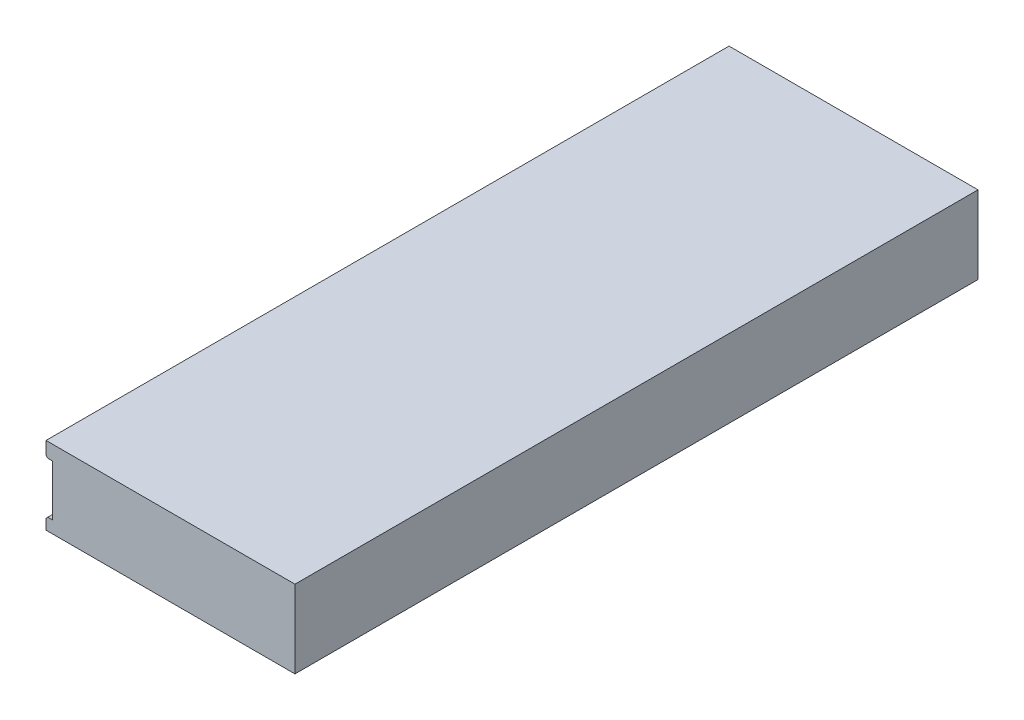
ISO-10303-21;
HEADER;
FILE_DESCRIPTION(('STEP AP214'),'2;1');
FILE_NAME('part.step','',(''),(''),'','','');
FILE_SCHEMA(('AUTOMOTIVE_DESIGN { 1 0 10303 214 1 1 1 1 }'));
ENDSEC;
DATA;
#1=APPLICATION_CONTEXT('core data for automotive mechanical design processes');
#2=APPLICATION_PROTOCOL_DEFINITION('international standard','automotive_design',2000,#1);
#3=PRODUCT_CONTEXT('',#1,'mechanical');
#4=PRODUCT('Part','Part','',(#3));
#5=PRODUCT_RELATED_PRODUCT_CATEGORY('part','',(#4));
#6=PRODUCT_DEFINITION_FORMATION('','',#4);
#7=PRODUCT_DEFINITION_CONTEXT('part definition',#1,'design');
#8=PRODUCT_DEFINITION('design','',#6,#7);
#9=PRODUCT_DEFINITION_SHAPE('','',#8);
#10=(LENGTH_UNIT() NAMED_UNIT(*) SI_UNIT(.MILLI.,.METRE.));
#11=(NAMED_UNIT(*) PLANE_ANGLE_UNIT() SI_UNIT($,.RADIAN.));
#12=(NAMED_UNIT(*) SI_UNIT($,.STERADIAN.) SOLID_ANGLE_UNIT());
#13=UNCERTAINTY_MEASURE_WITH_UNIT(LENGTH_MEASURE(1.E-05),#10,'distance_accuracy_value','');
#14=(GEOMETRIC_REPRESENTATION_CONTEXT(3) GLOBAL_UNCERTAINTY_ASSIGNED_CONTEXT((#13)) GLOBAL_UNIT_ASSIGNED_CONTEXT((#10,
#11,#12)) REPRESENTATION_CONTEXT('',''));
#15=CARTESIAN_POINT('',(0.,0.,0.));
#16=DIRECTION('',(0.,0.,1.));
#17=DIRECTION('',(1.,0.,0.));
#18=AXIS2_PLACEMENT_3D('',#15,#16,#17);
#19=CARTESIAN_POINT('',(-1.39699999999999,0.,71.4248));
#20=DIRECTION('',(0.,-1.,0.));
#21=DIRECTION('',(0.,0.,-1.));
#22=AXIS2_PLACEMENT_3D('',#19,#20,#21);
#23=PLANE('',#22);
#24=DIRECTION('',(-1.,0.,0.));
#25=VECTOR('',#24,1.);
#26=CARTESIAN_POINT('',(-1.39699999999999,0.,-71.4248));
#27=LINE('',#26,#25);
#28=CARTESIAN_POINT('',(50.673,0.,-71.4248));
#29=VERTEX_POINT('',#28);
#30=CARTESIAN_POINT('',(-1.39699999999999,0.,-71.4248));
#31=VERTEX_POINT('',#30);
#32=EDGE_CURVE('E180',#29,#31,#27,.T.);
#33=ORIENTED_EDGE('',*,*,#32,.T.);
#34=DIRECTION('',(0.,0.,-1.));
#35=VECTOR('',#34,1.);
#36=CARTESIAN_POINT('',(-1.39699999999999,0.,71.4248));
#37=LINE('',#36,#35);
#38=CARTESIAN_POINT('',(-1.39699999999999,0.,71.4248));
#39=VERTEX_POINT('',#38);
#40=EDGE_CURVE('E231',#39,#31,#37,.T.);
#41=ORIENTED_EDGE('',*,*,#40,.F.);
#42=DIRECTION('',(-1.,0.,0.));
#43=VECTOR('',#42,1.);
#44=CARTESIAN_POINT('',(-1.39699999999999,0.,71.4248));
#45=LINE('',#44,#43);
#46=CARTESIAN_POINT('',(50.673,0.,71.4248));
#47=VERTEX_POINT('',#46);
#48=EDGE_CURVE('E181',#47,#39,#45,.T.);
#49=ORIENTED_EDGE('',*,*,#48,.F.);
#50=DIRECTION('',(0.,0.,-1.));
#51=VECTOR('',#50,1.);
#52=CARTESIAN_POINT('',(50.673,0.,71.4248));
#53=LINE('',#52,#51);
#54=EDGE_CURVE('E200',#47,#29,#53,.T.);
#55=ORIENTED_EDGE('',*,*,#54,.T.);
#56=EDGE_LOOP('',(#33,#41,#49,#55));
#57=FACE_BOUND('',#56,.T.);
#58=ADVANCED_FACE('F37',(#57),#23,.F.);
#59=CARTESIAN_POINT('',(-1.39699999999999,-3.048,71.4248));
#60=DIRECTION('',(1.,0.,0.));
#61=DIRECTION('',(0.,0.,-1.));
#62=AXIS2_PLACEMENT_3D('',#59,#60,#61);
#63=PLANE('',#62);
#64=DIRECTION('',(0.,-1.,0.));
#65=VECTOR('',#64,1.);
#66=CARTESIAN_POINT('',(-1.39699999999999,-3.048,-71.4248));
#67=LINE('',#66,#65);
#68=CARTESIAN_POINT('',(-1.39699999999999,-2.66700000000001,-71.4248));
#69=VERTEX_POINT('',#68);
#70=EDGE_CURVE('E203',#31,#69,#67,.T.);
#71=ORIENTED_EDGE('',*,*,#70,.T.);
#72=DIRECTION('',(0.,0.,1.));
#73=VECTOR('',#72,1.);
#74=CARTESIAN_POINT('',(-1.39699999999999,-2.66700000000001,71.4248));
#75=LINE('',#74,#73);
#76=CARTESIAN_POINT('',(-1.39699999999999,-2.66700000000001,71.4248));
#77=VERTEX_POINT('',#76);
#78=EDGE_CURVE('E11',#69,#77,#75,.T.);
#79=ORIENTED_EDGE('',*,*,#78,.T.);
#80=DIRECTION('',(0.,-1.,0.));
#81=VECTOR('',#80,1.);
#82=CARTESIAN_POINT('',(-1.39699999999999,-3.048,71.4248));
#83=LINE('',#82,#81);
#84=EDGE_CURVE('E184',#39,#77,#83,.T.);
#85=ORIENTED_EDGE('',*,*,#84,.F.);
#86=ORIENTED_EDGE('',*,*,#40,.T.);
#87=EDGE_LOOP('',(#71,#79,#85,#86));
#88=FACE_BOUND('',#87,.T.);
#89=ADVANCED_FACE('F287',(#88),#63,.F.);
#90=CARTESIAN_POINT('',(0.,-3.048,71.4248));
#91=DIRECTION('',(0.,1.,0.));
#92=DIRECTION('',(0.,0.,1.));
#93=AXIS2_PLACEMENT_3D('',#90,#91,#92);
#94=PLANE('',#93);
#95=DIRECTION('',(1.,0.,0.));
#96=VECTOR('',#95,1.);
#97=CARTESIAN_POINT('',(0.,-3.048,71.4248));
#98=LINE('',#97,#96);
#99=CARTESIAN_POINT('',(-1.016,-3.048,71.4248));
#100=VERTEX_POINT('',#99);
#101=CARTESIAN_POINT('',(0.,-3.048,71.4248));
#102=VERTEX_POINT('',#101);
#103=EDGE_CURVE('E187',#100,#102,#98,.T.);
#104=ORIENTED_EDGE('',*,*,#103,.F.);
#105=DIRECTION('',(0.,0.,-1.));
#106=VECTOR('',#105,1.);
#107=CARTESIAN_POINT('',(-1.016,-3.048,71.4248));
#108=LINE('',#107,#106);
#109=CARTESIAN_POINT('',(-1.016,-3.048,-71.4248));
#110=VERTEX_POINT('',#109);
#111=EDGE_CURVE('E45',#100,#110,#108,.T.);
#112=ORIENTED_EDGE('',*,*,#111,.T.);
#113=DIRECTION('',(1.,0.,0.));
#114=VECTOR('',#113,1.);
#115=CARTESIAN_POINT('',(0.,-3.048,-71.4248));
#116=LINE('',#115,#114);
#117=CARTESIAN_POINT('',(0.,-3.048,-71.4248));
#118=VERTEX_POINT('',#117);
#119=EDGE_CURVE('E205',#110,#118,#116,.T.);
#120=ORIENTED_EDGE('',*,*,#119,.T.);
#121=DIRECTION('',(0.,0.,-1.));
#122=VECTOR('',#121,1.);
#123=CARTESIAN_POINT('',(0.,-3.048,71.4248));
#124=LINE('',#123,#122);
#125=EDGE_CURVE('E228',#102,#118,#124,.T.);
#126=ORIENTED_EDGE('',*,*,#125,.F.);
#127=EDGE_LOOP('',(#104,#112,#120,#126));
#128=FACE_BOUND('',#127,.T.);
#129=ADVANCED_FACE('F249',(#128),#94,.F.);
#130=CARTESIAN_POINT('',(0.,-13.716,71.4248));
#131=DIRECTION('',(1.,0.,0.));
#132=DIRECTION('',(0.,0.,-1.));
#133=AXIS2_PLACEMENT_3D('',#130,#131,#132);
#134=PLANE('',#133);
#135=CARTESIAN_POINT('',(0.,-8.128,-66.548));
#136=DIRECTION('',(-1.,0.,0.));
#137=DIRECTION('',(0.,0.,1.));
#138=AXIS2_PLACEMENT_3D('',#135,#136,#137);
#139=CIRCLE('',#138,2.413);
#140=CARTESIAN_POINT('',(0.,-8.128,-64.135));
#141=VERTEX_POINT('',#140);
#142=EDGE_CURVE('E141',#141,#141,#139,.T.);
#143=ORIENTED_EDGE('',*,*,#142,.F.);
#144=EDGE_LOOP('',(#143));
#145=FACE_BOUND('',#144,.T.);
#146=CARTESIAN_POINT('',(0.,-8.128,66.548));
#147=DIRECTION('',(-1.,0.,0.));
#148=DIRECTION('',(0.,0.,1.));
#149=AXIS2_PLACEMENT_3D('',#146,#147,#148);
#150=CIRCLE('',#149,2.413);
#151=CARTESIAN_POINT('',(0.,-8.128,68.961));
#152=VERTEX_POINT('',#151);
#153=EDGE_CURVE('E153',#152,#152,#150,.T.);
#154=ORIENTED_EDGE('',*,*,#153,.F.);
#155=EDGE_LOOP('',(#154));
#156=FACE_BOUND('',#155,.T.);
#157=CARTESIAN_POINT('',(0.,-8.128,4.8768));
#158=DIRECTION('',(-1.,0.,0.));
#159=DIRECTION('',(0.,0.,1.));
#160=AXIS2_PLACEMENT_3D('',#157,#158,#159);
#161=CIRCLE('',#160,2.413);
#162=CARTESIAN_POINT('',(0.,-8.128,7.2898));
#163=VERTEX_POINT('',#162);
#164=EDGE_CURVE('E165',#163,#163,#161,.T.);
#165=ORIENTED_EDGE('',*,*,#164,.F.);
#166=EDGE_LOOP('',(#165));
#167=FACE_BOUND('',#166,.T.);
#168=CARTESIAN_POINT('',(0.,-8.128,-4.8768));
#169=DIRECTION('',(-1.,0.,0.));
#170=DIRECTION('',(0.,0.,1.));
#171=AXIS2_PLACEMENT_3D('',#168,#169,#170);
#172=CIRCLE('',#171,2.413);
#173=CARTESIAN_POINT('',(0.,-8.128,-2.4638));
#174=VERTEX_POINT('',#173);
#175=EDGE_CURVE('E177',#174,#174,#172,.T.);
#176=ORIENTED_EDGE('',*,*,#175,.F.);
#177=EDGE_LOOP('',(#176));
#178=FACE_BOUND('',#177,.T.);
#179=DIRECTION('',(0.,-1.,0.));
#180=VECTOR('',#179,1.);
#181=CARTESIAN_POINT('',(0.,-13.716,-71.4248));
#182=LINE('',#181,#180);
#183=CARTESIAN_POINT('',(0.,-13.716,-71.4248));
#184=VERTEX_POINT('',#183);
#185=EDGE_CURVE('E207',#118,#184,#182,.T.);
#186=ORIENTED_EDGE('',*,*,#185,.T.);
#187=DIRECTION('',(0.,0.,-1.));
#188=VECTOR('',#187,1.);
#189=CARTESIAN_POINT('',(0.,-13.716,71.4248));
#190=LINE('',#189,#188);
#191=CARTESIAN_POINT('',(0.,-13.716,71.4248));
#192=VERTEX_POINT('',#191);
#193=EDGE_CURVE('E225',#192,#184,#190,.T.);
#194=ORIENTED_EDGE('',*,*,#193,.F.);
#195=DIRECTION('',(0.,-1.,0.));
#196=VECTOR('',#195,1.);
#197=CARTESIAN_POINT('',(0.,-13.716,71.4248));
#198=LINE('',#197,#196);
#199=EDGE_CURVE('E189',#102,#192,#198,.T.);
#200=ORIENTED_EDGE('',*,*,#199,.F.);
#201=ORIENTED_EDGE('',*,*,#125,.T.);
#202=EDGE_LOOP('',(#186,#194,#200,#201));
#203=FACE_BOUND('',#202,.T.);
#204=ADVANCED_FACE('F259',(#145,#156,#167,#178,#203),#134,.F.);
#205=CARTESIAN_POINT('',(-1.39699999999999,-13.716,71.4248));
#206=DIRECTION('',(0.,-1.,0.));
#207=DIRECTION('',(0.,0.,-1.));
#208=AXIS2_PLACEMENT_3D('',#205,#206,#207);
#209=PLANE('',#208);
#210=DIRECTION('',(-1.,0.,0.));
#211=VECTOR('',#210,1.);
#212=CARTESIAN_POINT('',(-1.39699999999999,-13.716,-71.4248));
#213=LINE('',#212,#211);
#214=CARTESIAN_POINT('',(-1.016,-13.716,-71.4248));
#215=VERTEX_POINT('',#214);
#216=EDGE_CURVE('E209',#184,#215,#213,.T.);
#217=ORIENTED_EDGE('',*,*,#216,.T.);
#218=DIRECTION('',(0.,0.,1.));
#219=VECTOR('',#218,1.);
#220=CARTESIAN_POINT('',(-1.016,-13.716,71.4248));
#221=LINE('',#220,#219);
#222=CARTESIAN_POINT('',(-1.016,-13.716,71.4248));
#223=VERTEX_POINT('',#222);
#224=EDGE_CURVE('E241',#215,#223,#221,.T.);
#225=ORIENTED_EDGE('',*,*,#224,.T.);
#226=DIRECTION('',(-1.,0.,0.));
#227=VECTOR('',#226,1.);
#228=CARTESIAN_POINT('',(-1.39699999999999,-13.716,71.4248));
#229=LINE('',#228,#227);
#230=EDGE_CURVE('E191',#192,#223,#229,.T.);
#231=ORIENTED_EDGE('',*,*,#230,.F.);
#232=ORIENTED_EDGE('',*,*,#193,.T.);
#233=EDGE_LOOP('',(#217,#225,#231,#232));
#234=FACE_BOUND('',#233,.T.);
#235=ADVANCED_FACE('F263',(#234),#209,.F.);
#236=CARTESIAN_POINT('',(-1.39699999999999,-16.256,71.4248));
#237=DIRECTION('',(1.,0.,0.));
#238=DIRECTION('',(0.,0.,-1.));
#239=AXIS2_PLACEMENT_3D('',#236,#237,#238);
#240=PLANE('',#239);
#241=DIRECTION('',(0.,-1.,0.));
#242=VECTOR('',#241,1.);
#243=CARTESIAN_POINT('',(-1.39699999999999,-16.256,71.4248));
#244=LINE('',#243,#242);
#245=CARTESIAN_POINT('',(-1.39699999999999,-14.097,71.4248));
#246=VERTEX_POINT('',#245);
#247=CARTESIAN_POINT('',(-1.39699999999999,-16.256,71.4248));
#248=VERTEX_POINT('',#247);
#249=EDGE_CURVE('E194',#246,#248,#244,.T.);
#250=ORIENTED_EDGE('',*,*,#249,.F.);
#251=DIRECTION('',(0.,0.,-1.));
#252=VECTOR('',#251,1.);
#253=CARTESIAN_POINT('',(-1.39699999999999,-14.097,71.4248));
#254=LINE('',#253,#252);
#255=CARTESIAN_POINT('',(-1.39699999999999,-14.097,-71.4248));
#256=VERTEX_POINT('',#255);
#257=EDGE_CURVE('E234',#246,#256,#254,.T.);
#258=ORIENTED_EDGE('',*,*,#257,.T.);
#259=DIRECTION('',(0.,-1.,0.));
#260=VECTOR('',#259,1.);
#261=CARTESIAN_POINT('',(-1.39699999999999,-16.256,-71.4248));
#262=LINE('',#261,#260);
#263=CARTESIAN_POINT('',(-1.39699999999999,-16.256,-71.4248));
#264=VERTEX_POINT('',#263);
#265=EDGE_CURVE('E212',#256,#264,#262,.T.);
#266=ORIENTED_EDGE('',*,*,#265,.T.);
#267=DIRECTION('',(0.,0.,-1.));
#268=VECTOR('',#267,1.);
#269=CARTESIAN_POINT('',(-1.39699999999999,-16.256,71.4248));
#270=LINE('',#269,#268);
#271=EDGE_CURVE('E222',#248,#264,#270,.T.);
#272=ORIENTED_EDGE('',*,*,#271,.F.);
#273=EDGE_LOOP('',(#250,#258,#266,#272));
#274=FACE_BOUND('',#273,.T.);
#275=ADVANCED_FACE('F271',(#274),#240,.F.);
#276=CARTESIAN_POINT('',(50.673,-16.256,71.4248));
#277=DIRECTION('',(0.,1.,0.));
#278=DIRECTION('',(-1.,0.,0.));
#279=AXIS2_PLACEMENT_3D('',#276,#277,#278);
#280=PLANE('',#279);
#281=DIRECTION('',(1.,0.,0.));
#282=VECTOR('',#281,1.);
#283=CARTESIAN_POINT('',(50.673,-16.256,-71.4248));
#284=LINE('',#283,#282);
#285=CARTESIAN_POINT('',(50.673,-16.256,-71.4248));
#286=VERTEX_POINT('',#285);
#287=EDGE_CURVE('E214',#264,#286,#284,.T.);
#288=ORIENTED_EDGE('',*,*,#287,.T.);
#289=DIRECTION('',(0.,0.,-1.));
#290=VECTOR('',#289,1.);
#291=CARTESIAN_POINT('',(50.673,-16.256,71.4248));
#292=LINE('',#291,#290);
#293=CARTESIAN_POINT('',(50.673,-16.256,71.4248));
#294=VERTEX_POINT('',#293);
#295=EDGE_CURVE('E219',#294,#286,#292,.T.);
#296=ORIENTED_EDGE('',*,*,#295,.F.);
#297=DIRECTION('',(1.,0.,0.));
#298=VECTOR('',#297,1.);
#299=CARTESIAN_POINT('',(50.673,-16.256,71.4248));
#300=LINE('',#299,#298);
#301=EDGE_CURVE('E196',#248,#294,#300,.T.);
#302=ORIENTED_EDGE('',*,*,#301,.F.);
#303=ORIENTED_EDGE('',*,*,#271,.T.);
#304=EDGE_LOOP('',(#288,#296,#302,#303));
#305=FACE_BOUND('',#304,.T.);
#306=ADVANCED_FACE('F278',(#305),#280,.F.);
#307=CARTESIAN_POINT('',(50.673,0.,71.4248));
#308=DIRECTION('',(-1.,0.,0.));
#309=DIRECTION('',(0.,0.,1.));
#310=AXIS2_PLACEMENT_3D('',#307,#308,#309);
#311=PLANE('',#310);
#312=DIRECTION('',(0.,1.,0.));
#313=VECTOR('',#312,1.);
#314=CARTESIAN_POINT('',(50.673,0.,-71.4248));
#315=LINE('',#314,#313);
#316=EDGE_CURVE('E185',#286,#29,#315,.T.);
#317=ORIENTED_EDGE('',*,*,#316,.T.);
#318=ORIENTED_EDGE('',*,*,#54,.F.);
#319=DIRECTION('',(0.,1.,0.));
#320=VECTOR('',#319,1.);
#321=CARTESIAN_POINT('',(50.673,0.,71.4248));
#322=LINE('',#321,#320);
#323=EDGE_CURVE('E198',#294,#47,#322,.T.);
#324=ORIENTED_EDGE('',*,*,#323,.F.);
#325=ORIENTED_EDGE('',*,*,#295,.T.);
#326=EDGE_LOOP('',(#317,#318,#324,#325));
#327=FACE_BOUND('',#326,.T.);
#328=ADVANCED_FACE('F282',(#327),#311,.F.);
#329=CARTESIAN_POINT('',(50.673,0.,71.4248));
#330=DIRECTION('',(0.,0.,-1.));
#331=DIRECTION('',(-1.,0.,0.));
#332=AXIS2_PLACEMENT_3D('',#329,#330,#331);
#333=PLANE('',#332);
#334=ORIENTED_EDGE('',*,*,#230,.T.);
#335=DIRECTION('',(0.70710678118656,0.707106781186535,0.));
#336=VECTOR('',#335,1.);
#337=CARTESIAN_POINT('',(-1.39699999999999,-14.097,71.4248));
#338=LINE('',#337,#336);
#339=EDGE_CURVE('E244',#223,#246,#338,.F.);
#340=ORIENTED_EDGE('',*,*,#339,.T.);
#341=ORIENTED_EDGE('',*,*,#249,.T.);
#342=ORIENTED_EDGE('',*,*,#301,.T.);
#343=ORIENTED_EDGE('',*,*,#323,.T.);
#344=ORIENTED_EDGE('',*,*,#48,.T.);
#345=ORIENTED_EDGE('',*,*,#84,.T.);
#346=DIRECTION('',(-0.707106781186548,0.707106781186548,0.));
#347=VECTOR('',#346,1.);
#348=CARTESIAN_POINT('',(-1.016,-3.048,71.4248));
#349=LINE('',#348,#347);
#350=EDGE_CURVE('E52',#77,#100,#349,.F.);
#351=ORIENTED_EDGE('',*,*,#350,.T.);
#352=ORIENTED_EDGE('',*,*,#103,.T.);
#353=ORIENTED_EDGE('',*,*,#199,.T.);
#354=EDGE_LOOP('',(#334,#340,#341,#342,#343,#344,#345,#351,#352,#353));
#355=FACE_BOUND('',#354,.T.);
#356=ADVANCED_FACE('F266',(#355),#333,.F.);
#357=CARTESIAN_POINT('',(50.673,0.,-71.4248));
#358=DIRECTION('',(0.,0.,-1.));
#359=DIRECTION('',(-1.,0.,0.));
#360=AXIS2_PLACEMENT_3D('',#357,#358,#359);
#361=PLANE('',#360);
#362=ORIENTED_EDGE('',*,*,#265,.F.);
#363=DIRECTION('',(-0.70710678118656,-0.707106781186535,0.));
#364=VECTOR('',#363,1.);
#365=CARTESIAN_POINT('',(31.686500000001,18.9864999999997,-71.4248));
#366=LINE('',#365,#364);
#367=EDGE_CURVE('E239',#256,#215,#366,.F.);
#368=ORIENTED_EDGE('',*,*,#367,.T.);
#369=ORIENTED_EDGE('',*,*,#216,.F.);
#370=ORIENTED_EDGE('',*,*,#185,.F.);
#371=ORIENTED_EDGE('',*,*,#119,.F.);
#372=DIRECTION('',(0.707106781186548,-0.707106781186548,0.));
#373=VECTOR('',#372,1.);
#374=CARTESIAN_POINT('',(23.3045,-27.3685,-71.4248));
#375=LINE('',#374,#373);
#376=EDGE_CURVE('E237',#110,#69,#375,.F.);
#377=ORIENTED_EDGE('',*,*,#376,.T.);
#378=ORIENTED_EDGE('',*,*,#70,.F.);
#379=ORIENTED_EDGE('',*,*,#32,.F.);
#380=ORIENTED_EDGE('',*,*,#316,.F.);
#381=ORIENTED_EDGE('',*,*,#287,.F.);
#382=EDGE_LOOP('',(#362,#368,#369,#370,#371,#377,#378,#379,#380,#381));
#383=FACE_BOUND('',#382,.T.);
#384=ADVANCED_FACE('F255',(#383),#361,.T.);
#385=CARTESIAN_POINT('',(0.,-8.128,-4.8768));
#386=DIRECTION('',(-1.,0.,0.));
#387=DIRECTION('',(0.,0.,1.));
#388=AXIS2_PLACEMENT_3D('',#385,#386,#387);
#389=CYLINDRICAL_SURFACE('',#388,2.413);
#390=CARTESIAN_POINT('',(7.62,-8.128,-4.8768));
#391=DIRECTION('',(-1.,0.,0.));
#392=DIRECTION('',(0.,0.,1.));
#393=AXIS2_PLACEMENT_3D('',#390,#391,#392);
#394=CIRCLE('',#393,2.413);
#395=CARTESIAN_POINT('',(7.62,-8.128,-2.4638));
#396=VERTEX_POINT('',#395);
#397=EDGE_CURVE('E174',#396,#396,#394,.T.);
#398=ORIENTED_EDGE('',*,*,#397,.F.);
#399=EDGE_LOOP('',(#398));
#400=FACE_BOUND('',#399,.T.);
#401=ORIENTED_EDGE('',*,*,#175,.T.);
#402=EDGE_LOOP('',(#401));
#403=FACE_BOUND('',#402,.T.);
#404=ADVANCED_FACE('F314',(#400,#403),#389,.F.);
#405=CARTESIAN_POINT('',(7.62,-6.10870000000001,-4.8768));
#406=DIRECTION('',(1.,0.,0.));
#407=DIRECTION('',(0.,0.,-1.));
#408=AXIS2_PLACEMENT_3D('',#405,#406,#407);
#409=PLANE('',#408);
#410=CARTESIAN_POINT('',(7.62,-8.128,-4.8768));
#411=DIRECTION('',(-1.,0.,0.));
#412=DIRECTION('',(0.,0.,1.));
#413=AXIS2_PLACEMENT_3D('',#410,#411,#412);
#414=CIRCLE('',#413,2.0193);
#415=CARTESIAN_POINT('',(7.62,-8.128,-2.8575));
#416=VERTEX_POINT('',#415);
#417=EDGE_CURVE('E171',#416,#416,#414,.T.);
#418=ORIENTED_EDGE('',*,*,#417,.F.);
#419=EDGE_LOOP('',(#418));
#420=FACE_BOUND('',#419,.T.);
#421=ORIENTED_EDGE('',*,*,#397,.T.);
#422=EDGE_LOOP('',(#421));
#423=FACE_BOUND('',#422,.T.);
#424=ADVANCED_FACE('F319',(#420,#423),#409,.F.);
#425=CARTESIAN_POINT('',(0.,-8.128,-4.8768));
#426=DIRECTION('',(-1.,0.,0.));
#427=DIRECTION('',(0.,0.,1.));
#428=AXIS2_PLACEMENT_3D('',#425,#426,#427);
#429=CYLINDRICAL_SURFACE('',#428,2.0193);
#430=CARTESIAN_POINT('',(9.99744,-8.128,-4.8768));
#431=DIRECTION('',(-1.,0.,0.));
#432=DIRECTION('',(0.,0.,1.));
#433=AXIS2_PLACEMENT_3D('',#430,#431,#432);
#434=CIRCLE('',#433,2.0193);
#435=CARTESIAN_POINT('',(9.99744,-8.128,-2.8575));
#436=VERTEX_POINT('',#435);
#437=EDGE_CURVE('E168',#436,#436,#434,.T.);
#438=ORIENTED_EDGE('',*,*,#437,.F.);
#439=EDGE_LOOP('',(#438));
#440=FACE_BOUND('',#439,.T.);
#441=ORIENTED_EDGE('',*,*,#417,.T.);
#442=EDGE_LOOP('',(#441));
#443=FACE_BOUND('',#442,.T.);
#444=ADVANCED_FACE('F323',(#440,#443),#429,.F.);
#445=CARTESIAN_POINT('',(9.99744,-8.128,-4.8768));
#446=DIRECTION('',(-1.,0.,0.));
#447=DIRECTION('',(0.,0.,1.));
#448=AXIS2_PLACEMENT_3D('',#445,#446,#447);
#449=CONICAL_SURFACE('',#448,2.0193,1.02974425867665);
#450=CARTESIAN_POINT('',(11.2107578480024,-8.12800000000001,-4.8768));
#451=VERTEX_POINT('',#450);
#452=VERTEX_LOOP('',#451);
#453=FACE_BOUND('',#452,.T.);
#454=ORIENTED_EDGE('',*,*,#437,.T.);
#455=EDGE_LOOP('',(#454));
#456=FACE_BOUND('',#455,.T.);
#457=ADVANCED_FACE('F327',(#453,#456),#449,.F.);
#458=CARTESIAN_POINT('',(0.,-8.128,4.8768));
#459=DIRECTION('',(-1.,0.,0.));
#460=DIRECTION('',(0.,0.,1.));
#461=AXIS2_PLACEMENT_3D('',#458,#459,#460);
#462=CYLINDRICAL_SURFACE('',#461,2.413);
#463=CARTESIAN_POINT('',(7.62,-8.128,4.8768));
#464=DIRECTION('',(-1.,0.,0.));
#465=DIRECTION('',(0.,0.,1.));
#466=AXIS2_PLACEMENT_3D('',#463,#464,#465);
#467=CIRCLE('',#466,2.413);
#468=CARTESIAN_POINT('',(7.62,-8.128,7.2898));
#469=VERTEX_POINT('',#468);
#470=EDGE_CURVE('E162',#469,#469,#467,.T.);
#471=ORIENTED_EDGE('',*,*,#470,.F.);
#472=EDGE_LOOP('',(#471));
#473=FACE_BOUND('',#472,.T.);
#474=ORIENTED_EDGE('',*,*,#164,.T.);
#475=EDGE_LOOP('',(#474));
#476=FACE_BOUND('',#475,.T.);
#477=ADVANCED_FACE('F331',(#473,#476),#462,.F.);
#478=CARTESIAN_POINT('',(7.62,-6.10870000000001,4.8768));
#479=DIRECTION('',(1.,0.,0.));
#480=DIRECTION('',(0.,0.,-1.));
#481=AXIS2_PLACEMENT_3D('',#478,#479,#480);
#482=PLANE('',#481);
#483=CARTESIAN_POINT('',(7.62,-8.128,4.8768));
#484=DIRECTION('',(-1.,0.,0.));
#485=DIRECTION('',(0.,0.,1.));
#486=AXIS2_PLACEMENT_3D('',#483,#484,#485);
#487=CIRCLE('',#486,2.0193);
#488=CARTESIAN_POINT('',(7.62,-8.128,6.8961));
#489=VERTEX_POINT('',#488);
#490=EDGE_CURVE('E159',#489,#489,#487,.T.);
#491=ORIENTED_EDGE('',*,*,#490,.F.);
#492=EDGE_LOOP('',(#491));
#493=FACE_BOUND('',#492,.T.);
#494=ORIENTED_EDGE('',*,*,#470,.T.);
#495=EDGE_LOOP('',(#494));
#496=FACE_BOUND('',#495,.T.);
#497=ADVANCED_FACE('F335',(#493,#496),#482,.F.);
#498=CARTESIAN_POINT('',(0.,-8.128,4.8768));
#499=DIRECTION('',(-1.,0.,0.));
#500=DIRECTION('',(0.,0.,1.));
#501=AXIS2_PLACEMENT_3D('',#498,#499,#500);
#502=CYLINDRICAL_SURFACE('',#501,2.0193);
#503=CARTESIAN_POINT('',(9.99744,-8.128,4.8768));
#504=DIRECTION('',(-1.,0.,0.));
#505=DIRECTION('',(0.,0.,1.));
#506=AXIS2_PLACEMENT_3D('',#503,#504,#505);
#507=CIRCLE('',#506,2.0193);
#508=CARTESIAN_POINT('',(9.99744,-8.128,6.8961));
#509=VERTEX_POINT('',#508);
#510=EDGE_CURVE('E156',#509,#509,#507,.T.);
#511=ORIENTED_EDGE('',*,*,#510,.F.);
#512=EDGE_LOOP('',(#511));
#513=FACE_BOUND('',#512,.T.);
#514=ORIENTED_EDGE('',*,*,#490,.T.);
#515=EDGE_LOOP('',(#514));
#516=FACE_BOUND('',#515,.T.);
#517=ADVANCED_FACE('F339',(#513,#516),#502,.F.);
#518=CARTESIAN_POINT('',(9.99744,-8.128,4.8768));
#519=DIRECTION('',(-1.,0.,0.));
#520=DIRECTION('',(0.,0.,1.));
#521=AXIS2_PLACEMENT_3D('',#518,#519,#520);
#522=CONICAL_SURFACE('',#521,2.0193,1.02974425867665);
#523=CARTESIAN_POINT('',(11.2107578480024,-8.12800000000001,4.8768));
#524=VERTEX_POINT('',#523);
#525=VERTEX_LOOP('',#524);
#526=FACE_BOUND('',#525,.T.);
#527=ORIENTED_EDGE('',*,*,#510,.T.);
#528=EDGE_LOOP('',(#527));
#529=FACE_BOUND('',#528,.T.);
#530=ADVANCED_FACE('F343',(#526,#529),#522,.F.);
#531=CARTESIAN_POINT('',(0.,-8.128,66.548));
#532=DIRECTION('',(-1.,0.,0.));
#533=DIRECTION('',(0.,0.,1.));
#534=AXIS2_PLACEMENT_3D('',#531,#532,#533);
#535=CYLINDRICAL_SURFACE('',#534,2.413);
#536=CARTESIAN_POINT('',(7.62,-8.128,66.548));
#537=DIRECTION('',(-1.,0.,0.));
#538=DIRECTION('',(0.,0.,1.));
#539=AXIS2_PLACEMENT_3D('',#536,#537,#538);
#540=CIRCLE('',#539,2.413);
#541=CARTESIAN_POINT('',(7.62,-8.128,68.961));
#542=VERTEX_POINT('',#541);
#543=EDGE_CURVE('E150',#542,#542,#540,.T.);
#544=ORIENTED_EDGE('',*,*,#543,.F.);
#545=EDGE_LOOP('',(#544));
#546=FACE_BOUND('',#545,.T.);
#547=ORIENTED_EDGE('',*,*,#153,.T.);
#548=EDGE_LOOP('',(#547));
#549=FACE_BOUND('',#548,.T.);
#550=ADVANCED_FACE('F347',(#546,#549),#535,.F.);
#551=CARTESIAN_POINT('',(7.62,-6.10870000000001,66.548));
#552=DIRECTION('',(1.,0.,0.));
#553=DIRECTION('',(0.,0.,-1.));
#554=AXIS2_PLACEMENT_3D('',#551,#552,#553);
#555=PLANE('',#554);
#556=CARTESIAN_POINT('',(7.62,-8.128,66.548));
#557=DIRECTION('',(-1.,0.,0.));
#558=DIRECTION('',(0.,0.,1.));
#559=AXIS2_PLACEMENT_3D('',#556,#557,#558);
#560=CIRCLE('',#559,2.0193);
#561=CARTESIAN_POINT('',(7.62,-8.128,68.5673));
#562=VERTEX_POINT('',#561);
#563=EDGE_CURVE('E147',#562,#562,#560,.T.);
#564=ORIENTED_EDGE('',*,*,#563,.F.);
#565=EDGE_LOOP('',(#564));
#566=FACE_BOUND('',#565,.T.);
#567=ORIENTED_EDGE('',*,*,#543,.T.);
#568=EDGE_LOOP('',(#567));
#569=FACE_BOUND('',#568,.T.);
#570=ADVANCED_FACE('F351',(#566,#569),#555,.F.);
#571=CARTESIAN_POINT('',(0.,-8.128,66.548));
#572=DIRECTION('',(-1.,0.,0.));
#573=DIRECTION('',(0.,0.,1.));
#574=AXIS2_PLACEMENT_3D('',#571,#572,#573);
#575=CYLINDRICAL_SURFACE('',#574,2.0193);
#576=CARTESIAN_POINT('',(9.99744,-8.128,66.548));
#577=DIRECTION('',(-1.,0.,0.));
#578=DIRECTION('',(0.,0.,1.));
#579=AXIS2_PLACEMENT_3D('',#576,#577,#578);
#580=CIRCLE('',#579,2.0193);
#581=CARTESIAN_POINT('',(9.99744,-8.128,68.5673));
#582=VERTEX_POINT('',#581);
#583=EDGE_CURVE('E144',#582,#582,#580,.T.);
#584=ORIENTED_EDGE('',*,*,#583,.F.);
#585=EDGE_LOOP('',(#584));
#586=FACE_BOUND('',#585,.T.);
#587=ORIENTED_EDGE('',*,*,#563,.T.);
#588=EDGE_LOOP('',(#587));
#589=FACE_BOUND('',#588,.T.);
#590=ADVANCED_FACE('F355',(#586,#589),#575,.F.);
#591=CARTESIAN_POINT('',(9.99744,-8.128,66.548));
#592=DIRECTION('',(-1.,0.,0.));
#593=DIRECTION('',(0.,0.,1.));
#594=AXIS2_PLACEMENT_3D('',#591,#592,#593);
#595=CONICAL_SURFACE('',#594,2.0193,1.02974425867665);
#596=CARTESIAN_POINT('',(11.2107578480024,-8.12800000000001,66.548));
#597=VERTEX_POINT('',#596);
#598=VERTEX_LOOP('',#597);
#599=FACE_BOUND('',#598,.T.);
#600=ORIENTED_EDGE('',*,*,#583,.T.);
#601=EDGE_LOOP('',(#600));
#602=FACE_BOUND('',#601,.T.);
#603=ADVANCED_FACE('F359',(#599,#602),#595,.F.);
#604=CARTESIAN_POINT('',(0.,-8.128,-66.548));
#605=DIRECTION('',(-1.,0.,0.));
#606=DIRECTION('',(0.,0.,1.));
#607=AXIS2_PLACEMENT_3D('',#604,#605,#606);
#608=CYLINDRICAL_SURFACE('',#607,2.413);
#609=CARTESIAN_POINT('',(7.61999999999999,-8.128,-66.548));
#610=DIRECTION('',(-1.,0.,0.));
#611=DIRECTION('',(0.,0.,1.));
#612=AXIS2_PLACEMENT_3D('',#609,#610,#611);
#613=CIRCLE('',#612,2.413);
#614=CARTESIAN_POINT('',(7.61999999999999,-8.128,-64.135));
#615=VERTEX_POINT('',#614);
#616=EDGE_CURVE('E136',#615,#615,#613,.T.);
#617=ORIENTED_EDGE('',*,*,#616,.F.);
#618=EDGE_LOOP('',(#617));
#619=FACE_BOUND('',#618,.T.);
#620=ORIENTED_EDGE('',*,*,#142,.T.);
#621=EDGE_LOOP('',(#620));
#622=FACE_BOUND('',#621,.T.);
#623=ADVANCED_FACE('F363',(#619,#622),#608,.F.);
#624=CARTESIAN_POINT('',(7.61999999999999,-6.10870000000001,-66.548));
#625=DIRECTION('',(1.,0.,0.));
#626=DIRECTION('',(0.,0.,-1.));
#627=AXIS2_PLACEMENT_3D('',#624,#625,#626);
#628=PLANE('',#627);
#629=CARTESIAN_POINT('',(7.61999999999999,-8.128,-66.548));
#630=DIRECTION('',(-1.,0.,0.));
#631=DIRECTION('',(0.,0.,1.));
#632=AXIS2_PLACEMENT_3D('',#629,#630,#631);
#633=CIRCLE('',#632,2.0193);
#634=CARTESIAN_POINT('',(7.61999999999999,-8.128,-64.5287));
#635=VERTEX_POINT('',#634);
#636=EDGE_CURVE('E133',#635,#635,#633,.T.);
#637=ORIENTED_EDGE('',*,*,#636,.F.);
#638=EDGE_LOOP('',(#637));
#639=FACE_BOUND('',#638,.T.);
#640=ORIENTED_EDGE('',*,*,#616,.T.);
#641=EDGE_LOOP('',(#640));
#642=FACE_BOUND('',#641,.T.);
#643=ADVANCED_FACE('F367',(#639,#642),#628,.F.);
#644=CARTESIAN_POINT('',(0.,-8.128,-66.548));
#645=DIRECTION('',(-1.,0.,0.));
#646=DIRECTION('',(0.,0.,1.));
#647=AXIS2_PLACEMENT_3D('',#644,#645,#646);
#648=CYLINDRICAL_SURFACE('',#647,2.0193);
#649=CARTESIAN_POINT('',(9.99744,-8.128,-66.548));
#650=DIRECTION('',(-1.,0.,0.));
#651=DIRECTION('',(0.,0.,1.));
#652=AXIS2_PLACEMENT_3D('',#649,#650,#651);
#653=CIRCLE('',#652,2.0193);
#654=CARTESIAN_POINT('',(9.99744,-8.128,-64.5287));
#655=VERTEX_POINT('',#654);
#656=EDGE_CURVE('E131',#655,#655,#653,.T.);
#657=ORIENTED_EDGE('',*,*,#656,.F.);
#658=EDGE_LOOP('',(#657));
#659=FACE_BOUND('',#658,.T.);
#660=ORIENTED_EDGE('',*,*,#636,.T.);
#661=EDGE_LOOP('',(#660));
#662=FACE_BOUND('',#661,.T.);
#663=ADVANCED_FACE('F127',(#659,#662),#648,.F.);
#664=CARTESIAN_POINT('',(9.99744,-8.128,-66.548));
#665=DIRECTION('',(-1.,0.,0.));
#666=DIRECTION('',(0.,0.,1.));
#667=AXIS2_PLACEMENT_3D('',#664,#665,#666);
#668=CONICAL_SURFACE('',#667,2.0193,1.02974425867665);
#669=CARTESIAN_POINT('',(11.2107578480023,-8.12800000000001,-66.548));
#670=VERTEX_POINT('',#669);
#671=VERTEX_LOOP('',#670);
#672=FACE_BOUND('',#671,.T.);
#673=ORIENTED_EDGE('',*,*,#656,.T.);
#674=EDGE_LOOP('',(#673));
#675=FACE_BOUND('',#674,.T.);
#676=ADVANCED_FACE('F123',(#672,#675),#668,.F.);
#677=CARTESIAN_POINT('',(-1.39699999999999,-14.097,71.4248));
#678=DIRECTION('',(0.707106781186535,-0.70710678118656,0.));
#679=DIRECTION('',(0.70710678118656,0.707106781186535,0.));
#680=AXIS2_PLACEMENT_3D('',#677,#678,#679);
#681=PLANE('',#680);
#682=ORIENTED_EDGE('',*,*,#339,.F.);
#683=ORIENTED_EDGE('',*,*,#224,.F.);
#684=ORIENTED_EDGE('',*,*,#367,.F.);
#685=ORIENTED_EDGE('',*,*,#257,.F.);
#686=EDGE_LOOP('',(#682,#683,#684,#685));
#687=FACE_BOUND('',#686,.T.);
#688=ADVANCED_FACE('F126',(#687),#681,.F.);
#689=CARTESIAN_POINT('',(-1.016,-3.048,71.4248));
#690=DIRECTION('',(0.707106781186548,0.707106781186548,0.));
#691=DIRECTION('',(-0.707106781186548,0.707106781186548,0.));
#692=AXIS2_PLACEMENT_3D('',#689,#690,#691);
#693=PLANE('',#692);
#694=ORIENTED_EDGE('',*,*,#350,.F.);
#695=ORIENTED_EDGE('',*,*,#78,.F.);
#696=ORIENTED_EDGE('',*,*,#376,.F.);
#697=ORIENTED_EDGE('',*,*,#111,.F.);
#698=EDGE_LOOP('',(#694,#695,#696,#697));
#699=FACE_BOUND('',#698,.T.);
#700=ADVANCED_FACE('F39',(#699),#693,.F.);
#701=CLOSED_SHELL('',(#58,#89,#129,#204,#235,#275,#306,#328,#356,#384,#404,#424,#444,#457,#477,
#497,#517,#530,#550,#570,#590,#603,#623,#643,#663,#676,#688,#700));
#702=MANIFOLD_SOLID_BREP('B2',#701);
#703=ADVANCED_BREP_SHAPE_REPRESENTATION('',(#18,#702),#14);
#704=SHAPE_DEFINITION_REPRESENTATION(#9,#703);
ENDSEC;
END-ISO-10303-21;
